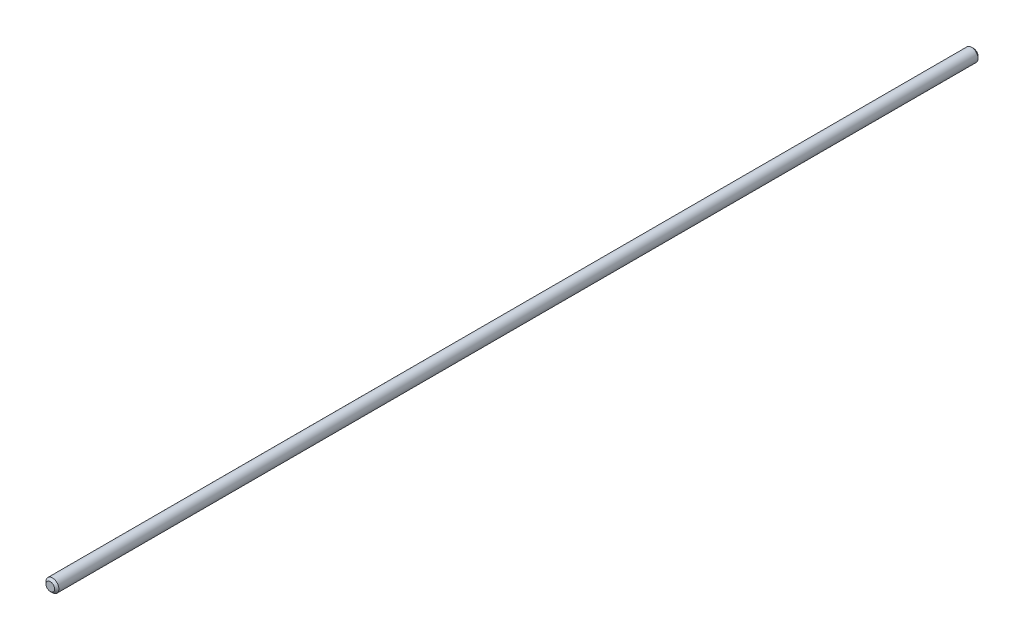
from build123d import *

# Parameters (mm, degrees)
ESQUISSE1_R      = 3
EXTRUSION1_DEPTH = 430
CHANFREIN1_SIZE  = 1


with BuildPart() as part:
    # Esquisse1 → Extrusion1 (new body)
    with BuildSketch(Plane.XY):
        Circle(ESQUISSE1_R)
    extrude(amount=EXTRUSION1_DEPTH)

    # Chanfrein1
    chanfrein1_edges = [part.edges().sort_by_distance(p)[0] for p in [
        (-3, 0, 0),
        (-3, 0, 430),
    ]]
    chamfer(chanfrein1_edges, length=CHANFREIN1_SIZE)


solid = part.part
